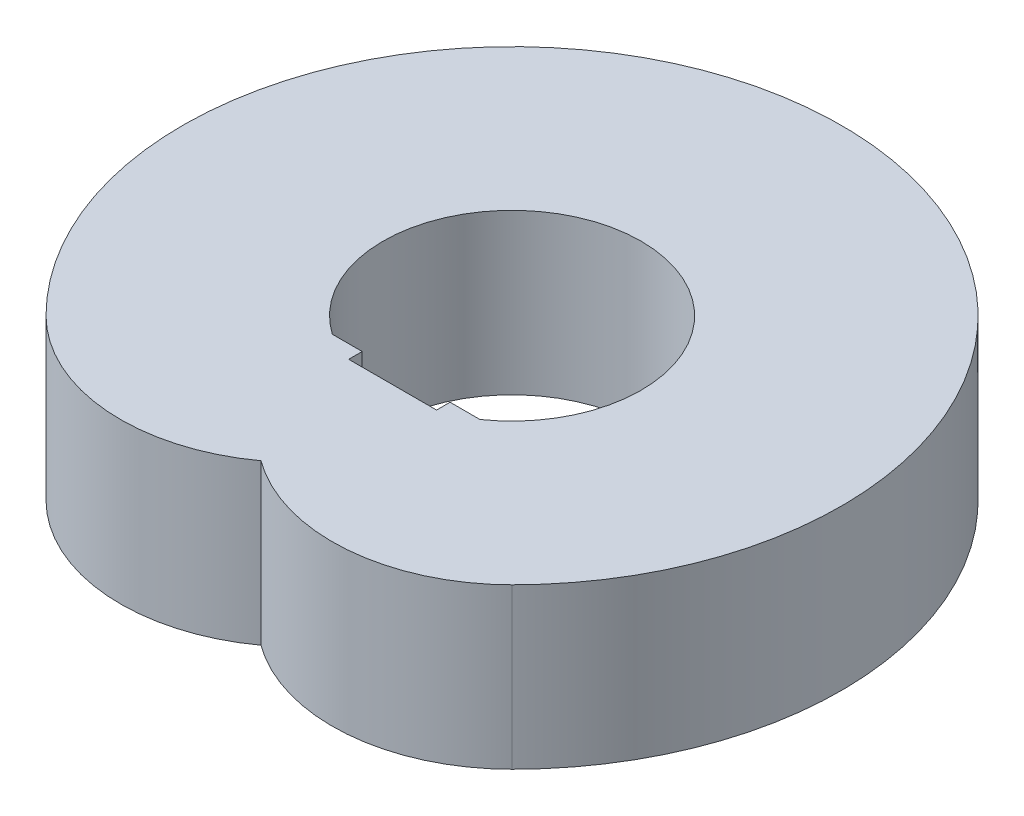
ISO-10303-21;
HEADER;
FILE_DESCRIPTION(('STEP AP214'),'2;1');
FILE_NAME('part.step','',(''),(''),'','','');
FILE_SCHEMA(('AUTOMOTIVE_DESIGN { 1 0 10303 214 1 1 1 1 }'));
ENDSEC;
DATA;
#1=APPLICATION_CONTEXT('core data for automotive mechanical design processes');
#2=APPLICATION_PROTOCOL_DEFINITION('international standard','automotive_design',2000,#1);
#3=PRODUCT_CONTEXT('',#1,'mechanical');
#4=PRODUCT('Part','Part','',(#3));
#5=PRODUCT_RELATED_PRODUCT_CATEGORY('part','',(#4));
#6=PRODUCT_DEFINITION_FORMATION('','',#4);
#7=PRODUCT_DEFINITION_CONTEXT('part definition',#1,'design');
#8=PRODUCT_DEFINITION('design','',#6,#7);
#9=PRODUCT_DEFINITION_SHAPE('','',#8);
#10=(LENGTH_UNIT() NAMED_UNIT(*) SI_UNIT(.MILLI.,.METRE.));
#11=(NAMED_UNIT(*) PLANE_ANGLE_UNIT() SI_UNIT($,.RADIAN.));
#12=(NAMED_UNIT(*) SI_UNIT($,.STERADIAN.) SOLID_ANGLE_UNIT());
#13=UNCERTAINTY_MEASURE_WITH_UNIT(LENGTH_MEASURE(1.E-05),#10,'distance_accuracy_value','');
#14=(GEOMETRIC_REPRESENTATION_CONTEXT(3) GLOBAL_UNCERTAINTY_ASSIGNED_CONTEXT((#13)) GLOBAL_UNIT_ASSIGNED_CONTEXT((#10,
#11,#12)) REPRESENTATION_CONTEXT('',''));
#15=CARTESIAN_POINT('',(0.,0.,0.));
#16=DIRECTION('',(0.,0.,1.));
#17=DIRECTION('',(1.,0.,0.));
#18=AXIS2_PLACEMENT_3D('',#15,#16,#17);
#19=CARTESIAN_POINT('',(132.582521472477,400.,132.582521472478));
#20=DIRECTION('',(0.,1.,0.));
#21=DIRECTION('',(0.,0.,1.));
#22=AXIS2_PLACEMENT_3D('',#19,#20,#21);
#23=PLANE('',#22);
#24=CARTESIAN_POINT('',(265.165042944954,400.,265.165042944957));
#25=DIRECTION('',(0.,1.,0.));
#26=DIRECTION('',(0.,0.,1.));
#27=AXIS2_PLACEMENT_3D('',#24,#25,#26);
#28=CIRCLE('',#27,449.999999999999);
#29=CARTESIAN_POINT('',(1.83186799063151E-12,400.,628.741032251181));
#30=VERTEX_POINT('',#29);
#31=CARTESIAN_POINT('',(583.363094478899,400.,583.363094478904));
#32=VERTEX_POINT('',#31);
#33=EDGE_CURVE('E157',#30,#32,#28,.T.);
#34=ORIENTED_EDGE('',*,*,#33,.T.);
#35=CARTESIAN_POINT('',(0.,400.,0.));
#36=DIRECTION('',(0.,1.,0.));
#37=DIRECTION('',(0.,0.,1.));
#38=AXIS2_PLACEMENT_3D('',#35,#36,#37);
#39=CIRCLE('',#38,825.);
#40=CARTESIAN_POINT('',(-583.363094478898,400.,583.363094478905));
#41=VERTEX_POINT('',#40);
#42=EDGE_CURVE('E160',#32,#41,#39,.T.);
#43=ORIENTED_EDGE('',*,*,#42,.T.);
#44=CARTESIAN_POINT('',(-265.165042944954,400.,265.165042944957));
#45=DIRECTION('',(0.,1.,0.));
#46=DIRECTION('',(0.,0.,1.));
#47=AXIS2_PLACEMENT_3D('',#44,#45,#46);
#48=CIRCLE('',#47,450.);
#49=EDGE_CURVE('E163',#41,#30,#48,.T.);
#50=ORIENTED_EDGE('',*,*,#49,.T.);
#51=EDGE_LOOP('',(#34,#43,#50));
#52=FACE_BOUND('',#51,.T.);
#53=DIRECTION('',(0.,0.,1.));
#54=VECTOR('',#53,1.);
#55=CARTESIAN_POINT('',(-110.,400.,265.165042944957));
#56=LINE('',#55,#54);
#57=CARTESIAN_POINT('',(-110.,400.,265.165042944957));
#58=VERTEX_POINT('',#57);
#59=CARTESIAN_POINT('',(-110.,400.,299.));
#60=VERTEX_POINT('',#59);
#61=EDGE_CURVE('E114',#58,#60,#56,.T.);
#62=ORIENTED_EDGE('',*,*,#61,.F.);
#63=DIRECTION('',(1.,0.,0.));
#64=VECTOR('',#63,1.);
#65=CARTESIAN_POINT('',(-110.,400.,265.165042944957));
#66=LINE('',#65,#64);
#67=CARTESIAN_POINT('',(-184.834957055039,400.,265.165042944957));
#68=VERTEX_POINT('',#67);
#69=EDGE_CURVE('E106',#68,#58,#66,.T.);
#70=ORIENTED_EDGE('',*,*,#69,.F.);
#71=CARTESIAN_POINT('',(0.,400.,0.));
#72=DIRECTION('',(0.,1.,0.));
#73=DIRECTION('',(0.,0.,1.));
#74=AXIS2_PLACEMENT_3D('',#71,#72,#73);
#75=CIRCLE('',#74,323.228187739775);
#76=CARTESIAN_POINT('',(184.834957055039,400.,265.165042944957));
#77=VERTEX_POINT('',#76);
#78=EDGE_CURVE('E135',#77,#68,#75,.T.);
#79=ORIENTED_EDGE('',*,*,#78,.F.);
#80=DIRECTION('',(1.,0.,0.));
#81=VECTOR('',#80,1.);
#82=CARTESIAN_POINT('',(184.834957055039,400.,265.165042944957));
#83=LINE('',#82,#81);
#84=CARTESIAN_POINT('',(110.,400.,265.165042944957));
#85=VERTEX_POINT('',#84);
#86=EDGE_CURVE('E133',#85,#77,#83,.T.);
#87=ORIENTED_EDGE('',*,*,#86,.F.);
#88=DIRECTION('',(0.,0.,-1.));
#89=VECTOR('',#88,1.);
#90=CARTESIAN_POINT('',(110.,400.,265.165042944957));
#91=LINE('',#90,#89);
#92=CARTESIAN_POINT('',(110.,400.,299.));
#93=VERTEX_POINT('',#92);
#94=EDGE_CURVE('E129',#93,#85,#91,.T.);
#95=ORIENTED_EDGE('',*,*,#94,.F.);
#96=DIRECTION('',(1.,0.,0.));
#97=VECTOR('',#96,1.);
#98=CARTESIAN_POINT('',(-110.,400.,299.));
#99=LINE('',#98,#97);
#100=EDGE_CURVE('E127',#60,#93,#99,.T.);
#101=ORIENTED_EDGE('',*,*,#100,.F.);
#102=EDGE_LOOP('',(#62,#70,#79,#87,#95,#101));
#103=FACE_BOUND('',#102,.T.);
#104=ADVANCED_FACE('F35',(#52,#103),#23,.T.);
#105=CARTESIAN_POINT('',(132.582521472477,0.,132.582521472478));
#106=DIRECTION('',(0.,1.,0.));
#107=DIRECTION('',(0.,0.,1.));
#108=AXIS2_PLACEMENT_3D('',#105,#106,#107);
#109=PLANE('',#108);
#110=CARTESIAN_POINT('',(265.165042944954,0.,265.165042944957));
#111=DIRECTION('',(0.,1.,0.));
#112=DIRECTION('',(0.,0.,1.));
#113=AXIS2_PLACEMENT_3D('',#110,#111,#112);
#114=CIRCLE('',#113,449.999999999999);
#115=CARTESIAN_POINT('',(1.83186799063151E-12,0.,628.741032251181));
#116=VERTEX_POINT('',#115);
#117=CARTESIAN_POINT('',(583.363094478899,0.,583.363094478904));
#118=VERTEX_POINT('',#117);
#119=EDGE_CURVE('E122',#116,#118,#114,.T.);
#120=ORIENTED_EDGE('',*,*,#119,.F.);
#121=CARTESIAN_POINT('',(-265.165042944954,0.,265.165042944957));
#122=DIRECTION('',(0.,1.,0.));
#123=DIRECTION('',(0.,0.,1.));
#124=AXIS2_PLACEMENT_3D('',#121,#122,#123);
#125=CIRCLE('',#124,450.);
#126=CARTESIAN_POINT('',(-583.363094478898,0.,583.363094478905));
#127=VERTEX_POINT('',#126);
#128=EDGE_CURVE('E161',#127,#116,#125,.T.);
#129=ORIENTED_EDGE('',*,*,#128,.F.);
#130=CARTESIAN_POINT('',(0.,0.,0.));
#131=DIRECTION('',(0.,1.,0.));
#132=DIRECTION('',(0.,0.,1.));
#133=AXIS2_PLACEMENT_3D('',#130,#131,#132);
#134=CIRCLE('',#133,825.);
#135=EDGE_CURVE('E168',#118,#127,#134,.T.);
#136=ORIENTED_EDGE('',*,*,#135,.F.);
#137=EDGE_LOOP('',(#120,#129,#136));
#138=FACE_BOUND('',#137,.T.);
#139=DIRECTION('',(1.,0.,0.));
#140=VECTOR('',#139,1.);
#141=CARTESIAN_POINT('',(-110.,0.,265.165042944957));
#142=LINE('',#141,#140);
#143=CARTESIAN_POINT('',(-184.834957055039,0.,265.165042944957));
#144=VERTEX_POINT('',#143);
#145=CARTESIAN_POINT('',(-110.,0.,265.165042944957));
#146=VERTEX_POINT('',#145);
#147=EDGE_CURVE('E58',#144,#146,#142,.T.);
#148=ORIENTED_EDGE('',*,*,#147,.T.);
#149=DIRECTION('',(0.,0.,1.));
#150=VECTOR('',#149,1.);
#151=CARTESIAN_POINT('',(-110.,0.,265.165042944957));
#152=LINE('',#151,#150);
#153=CARTESIAN_POINT('',(-110.,0.,299.));
#154=VERTEX_POINT('',#153);
#155=EDGE_CURVE('E121',#146,#154,#152,.T.);
#156=ORIENTED_EDGE('',*,*,#155,.T.);
#157=DIRECTION('',(1.,0.,0.));
#158=VECTOR('',#157,1.);
#159=CARTESIAN_POINT('',(-110.,0.,299.));
#160=LINE('',#159,#158);
#161=CARTESIAN_POINT('',(110.,0.,299.));
#162=VERTEX_POINT('',#161);
#163=EDGE_CURVE('E139',#154,#162,#160,.T.);
#164=ORIENTED_EDGE('',*,*,#163,.T.);
#165=DIRECTION('',(0.,0.,-1.));
#166=VECTOR('',#165,1.);
#167=CARTESIAN_POINT('',(110.,0.,265.165042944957));
#168=LINE('',#167,#166);
#169=CARTESIAN_POINT('',(110.,0.,265.165042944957));
#170=VERTEX_POINT('',#169);
#171=EDGE_CURVE('E142',#162,#170,#168,.T.);
#172=ORIENTED_EDGE('',*,*,#171,.T.);
#173=DIRECTION('',(1.,0.,0.));
#174=VECTOR('',#173,1.);
#175=CARTESIAN_POINT('',(184.834957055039,0.,265.165042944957));
#176=LINE('',#175,#174);
#177=CARTESIAN_POINT('',(184.834957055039,0.,265.165042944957));
#178=VERTEX_POINT('',#177);
#179=EDGE_CURVE('E145',#170,#178,#176,.T.);
#180=ORIENTED_EDGE('',*,*,#179,.T.);
#181=CARTESIAN_POINT('',(0.,0.,0.));
#182=DIRECTION('',(0.,1.,0.));
#183=DIRECTION('',(0.,0.,1.));
#184=AXIS2_PLACEMENT_3D('',#181,#182,#183);
#185=CIRCLE('',#184,323.228187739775);
#186=EDGE_CURVE('E115',#178,#144,#185,.T.);
#187=ORIENTED_EDGE('',*,*,#186,.T.);
#188=EDGE_LOOP('',(#148,#156,#164,#172,#180,#187));
#189=FACE_BOUND('',#188,.T.);
#190=ADVANCED_FACE('F182',(#138,#189),#109,.F.);
#191=CARTESIAN_POINT('',(265.165042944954,400.,265.165042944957));
#192=DIRECTION('',(0.,-1.,0.));
#193=DIRECTION('',(0.,0.,-1.));
#194=AXIS2_PLACEMENT_3D('',#191,#192,#193);
#195=CYLINDRICAL_SURFACE('',#194,449.999999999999);
#196=ORIENTED_EDGE('',*,*,#119,.T.);
#197=DIRECTION('',(0.,-1.,0.));
#198=VECTOR('',#197,1.);
#199=CARTESIAN_POINT('',(583.363094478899,400.,583.363094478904));
#200=LINE('',#199,#198);
#201=EDGE_CURVE('E11',#32,#118,#200,.T.);
#202=ORIENTED_EDGE('',*,*,#201,.F.);
#203=ORIENTED_EDGE('',*,*,#33,.F.);
#204=DIRECTION('',(0.,-1.,0.));
#205=VECTOR('',#204,1.);
#206=CARTESIAN_POINT('',(1.83186799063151E-12,400.,628.741032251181));
#207=LINE('',#206,#205);
#208=EDGE_CURVE('E165',#30,#116,#207,.T.);
#209=ORIENTED_EDGE('',*,*,#208,.T.);
#210=EDGE_LOOP('',(#196,#202,#203,#209));
#211=FACE_BOUND('',#210,.T.);
#212=ADVANCED_FACE('F37',(#211),#195,.T.);
#213=CARTESIAN_POINT('',(0.,400.,0.));
#214=DIRECTION('',(0.,-1.,0.));
#215=DIRECTION('',(0.,0.,-1.));
#216=AXIS2_PLACEMENT_3D('',#213,#214,#215);
#217=CYLINDRICAL_SURFACE('',#216,825.);
#218=ORIENTED_EDGE('',*,*,#135,.T.);
#219=DIRECTION('',(0.,-1.,0.));
#220=VECTOR('',#219,1.);
#221=CARTESIAN_POINT('',(-583.363094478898,400.,583.363094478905));
#222=LINE('',#221,#220);
#223=EDGE_CURVE('E43',#41,#127,#222,.T.);
#224=ORIENTED_EDGE('',*,*,#223,.F.);
#225=ORIENTED_EDGE('',*,*,#42,.F.);
#226=ORIENTED_EDGE('',*,*,#201,.T.);
#227=EDGE_LOOP('',(#218,#224,#225,#226));
#228=FACE_BOUND('',#227,.T.);
#229=ADVANCED_FACE('F188',(#228),#217,.T.);
#230=CARTESIAN_POINT('',(-265.165042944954,400.,265.165042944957));
#231=DIRECTION('',(0.,-1.,0.));
#232=DIRECTION('',(0.,0.,-1.));
#233=AXIS2_PLACEMENT_3D('',#230,#231,#232);
#234=CYLINDRICAL_SURFACE('',#233,450.);
#235=ORIENTED_EDGE('',*,*,#128,.T.);
#236=ORIENTED_EDGE('',*,*,#208,.F.);
#237=ORIENTED_EDGE('',*,*,#49,.F.);
#238=ORIENTED_EDGE('',*,*,#223,.T.);
#239=EDGE_LOOP('',(#235,#236,#237,#238));
#240=FACE_BOUND('',#239,.T.);
#241=ADVANCED_FACE('F177',(#240),#234,.T.);
#242=CARTESIAN_POINT('',(-110.,400.,265.165042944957));
#243=DIRECTION('',(0.,0.,-1.));
#244=DIRECTION('',(-1.,0.,0.));
#245=AXIS2_PLACEMENT_3D('',#242,#243,#244);
#246=PLANE('',#245);
#247=ORIENTED_EDGE('',*,*,#147,.F.);
#248=DIRECTION('',(0.,-1.,0.));
#249=VECTOR('',#248,1.);
#250=CARTESIAN_POINT('',(-184.834957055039,400.,265.165042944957));
#251=LINE('',#250,#249);
#252=EDGE_CURVE('E110',#68,#144,#251,.T.);
#253=ORIENTED_EDGE('',*,*,#252,.F.);
#254=ORIENTED_EDGE('',*,*,#69,.T.);
#255=DIRECTION('',(0.,-1.,0.));
#256=VECTOR('',#255,1.);
#257=CARTESIAN_POINT('',(-110.,400.,265.165042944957));
#258=LINE('',#257,#256);
#259=EDGE_CURVE('E109',#58,#146,#258,.T.);
#260=ORIENTED_EDGE('',*,*,#259,.T.);
#261=EDGE_LOOP('',(#247,#253,#254,#260));
#262=FACE_BOUND('',#261,.T.);
#263=ADVANCED_FACE('F108',(#262),#246,.T.);
#264=CARTESIAN_POINT('',(-110.,400.,265.165042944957));
#265=DIRECTION('',(1.,0.,0.));
#266=DIRECTION('',(0.,0.,-1.));
#267=AXIS2_PLACEMENT_3D('',#264,#265,#266);
#268=PLANE('',#267);
#269=ORIENTED_EDGE('',*,*,#155,.F.);
#270=ORIENTED_EDGE('',*,*,#259,.F.);
#271=ORIENTED_EDGE('',*,*,#61,.T.);
#272=DIRECTION('',(0.,-1.,0.));
#273=VECTOR('',#272,1.);
#274=CARTESIAN_POINT('',(-110.,400.,299.));
#275=LINE('',#274,#273);
#276=EDGE_CURVE('E123',#60,#154,#275,.T.);
#277=ORIENTED_EDGE('',*,*,#276,.T.);
#278=EDGE_LOOP('',(#269,#270,#271,#277));
#279=FACE_BOUND('',#278,.T.);
#280=ADVANCED_FACE('F118',(#279),#268,.T.);
#281=CARTESIAN_POINT('',(-110.,400.,299.));
#282=DIRECTION('',(0.,0.,-1.));
#283=DIRECTION('',(-1.,0.,0.));
#284=AXIS2_PLACEMENT_3D('',#281,#282,#283);
#285=PLANE('',#284);
#286=ORIENTED_EDGE('',*,*,#163,.F.);
#287=ORIENTED_EDGE('',*,*,#276,.F.);
#288=ORIENTED_EDGE('',*,*,#100,.T.);
#289=DIRECTION('',(0.,-1.,0.));
#290=VECTOR('',#289,1.);
#291=CARTESIAN_POINT('',(110.,400.,299.));
#292=LINE('',#291,#290);
#293=EDGE_CURVE('E154',#93,#162,#292,.T.);
#294=ORIENTED_EDGE('',*,*,#293,.T.);
#295=EDGE_LOOP('',(#286,#287,#288,#294));
#296=FACE_BOUND('',#295,.T.);
#297=ADVANCED_FACE('F206',(#296),#285,.T.);
#298=CARTESIAN_POINT('',(110.,400.,265.165042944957));
#299=DIRECTION('',(-1.,0.,0.));
#300=DIRECTION('',(0.,0.,1.));
#301=AXIS2_PLACEMENT_3D('',#298,#299,#300);
#302=PLANE('',#301);
#303=ORIENTED_EDGE('',*,*,#171,.F.);
#304=ORIENTED_EDGE('',*,*,#293,.F.);
#305=ORIENTED_EDGE('',*,*,#94,.T.);
#306=DIRECTION('',(0.,-1.,0.));
#307=VECTOR('',#306,1.);
#308=CARTESIAN_POINT('',(110.,400.,265.165042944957));
#309=LINE('',#308,#307);
#310=EDGE_CURVE('E152',#85,#170,#309,.T.);
#311=ORIENTED_EDGE('',*,*,#310,.T.);
#312=EDGE_LOOP('',(#303,#304,#305,#311));
#313=FACE_BOUND('',#312,.T.);
#314=ADVANCED_FACE('F209',(#313),#302,.T.);
#315=CARTESIAN_POINT('',(184.834957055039,400.,265.165042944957));
#316=DIRECTION('',(0.,0.,-1.));
#317=DIRECTION('',(-1.,0.,0.));
#318=AXIS2_PLACEMENT_3D('',#315,#316,#317);
#319=PLANE('',#318);
#320=ORIENTED_EDGE('',*,*,#179,.F.);
#321=ORIENTED_EDGE('',*,*,#310,.F.);
#322=ORIENTED_EDGE('',*,*,#86,.T.);
#323=DIRECTION('',(0.,-1.,0.));
#324=VECTOR('',#323,1.);
#325=CARTESIAN_POINT('',(184.834957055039,400.,265.165042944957));
#326=LINE('',#325,#324);
#327=EDGE_CURVE('E50',#77,#178,#326,.T.);
#328=ORIENTED_EDGE('',*,*,#327,.T.);
#329=EDGE_LOOP('',(#320,#321,#322,#328));
#330=FACE_BOUND('',#329,.T.);
#331=ADVANCED_FACE('F213',(#330),#319,.T.);
#332=CARTESIAN_POINT('',(0.,400.,0.));
#333=DIRECTION('',(0.,-1.,0.));
#334=DIRECTION('',(0.,0.,-1.));
#335=AXIS2_PLACEMENT_3D('',#332,#333,#334);
#336=CYLINDRICAL_SURFACE('',#335,323.228187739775);
#337=ORIENTED_EDGE('',*,*,#186,.F.);
#338=ORIENTED_EDGE('',*,*,#327,.F.);
#339=ORIENTED_EDGE('',*,*,#78,.T.);
#340=ORIENTED_EDGE('',*,*,#252,.T.);
#341=EDGE_LOOP('',(#337,#338,#339,#340));
#342=FACE_BOUND('',#341,.T.);
#343=ADVANCED_FACE('F217',(#342),#336,.F.);
#344=CLOSED_SHELL('',(#104,#190,#212,#229,#241,#263,#280,#297,#314,#331,#343));
#345=MANIFOLD_SOLID_BREP('B2',#344);
#346=ADVANCED_BREP_SHAPE_REPRESENTATION('',(#18,#345),#14);
#347=SHAPE_DEFINITION_REPRESENTATION(#9,#346);
ENDSEC;
END-ISO-10303-21;
